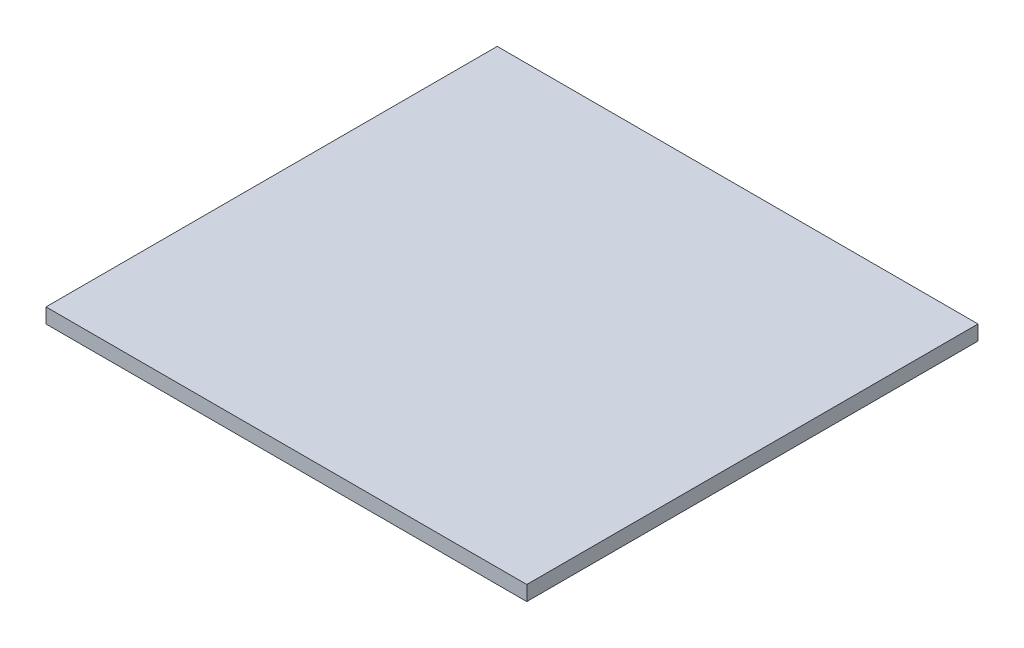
from build123d import *

# Parameters (mm, degrees)
SKETCH2_W           = 81.000000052
SKETCH2_H           = 76.020000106
BOSS_EXTRUDE1_DEPTH = 2.5


with BuildPart() as part:
    # Sketch2 → Boss-Extrude1 (new body)
    with BuildSketch(Plane(origin=(0, 0, 0), x_dir=(1, 0, 0), z_dir=(0, 1, 0))):
        with Locations((-26.00669011, 21.989999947)):
            Rectangle(SKETCH2_W, SKETCH2_H)
    extrude(amount=BOSS_EXTRUDE1_DEPTH)


solid = part.part
